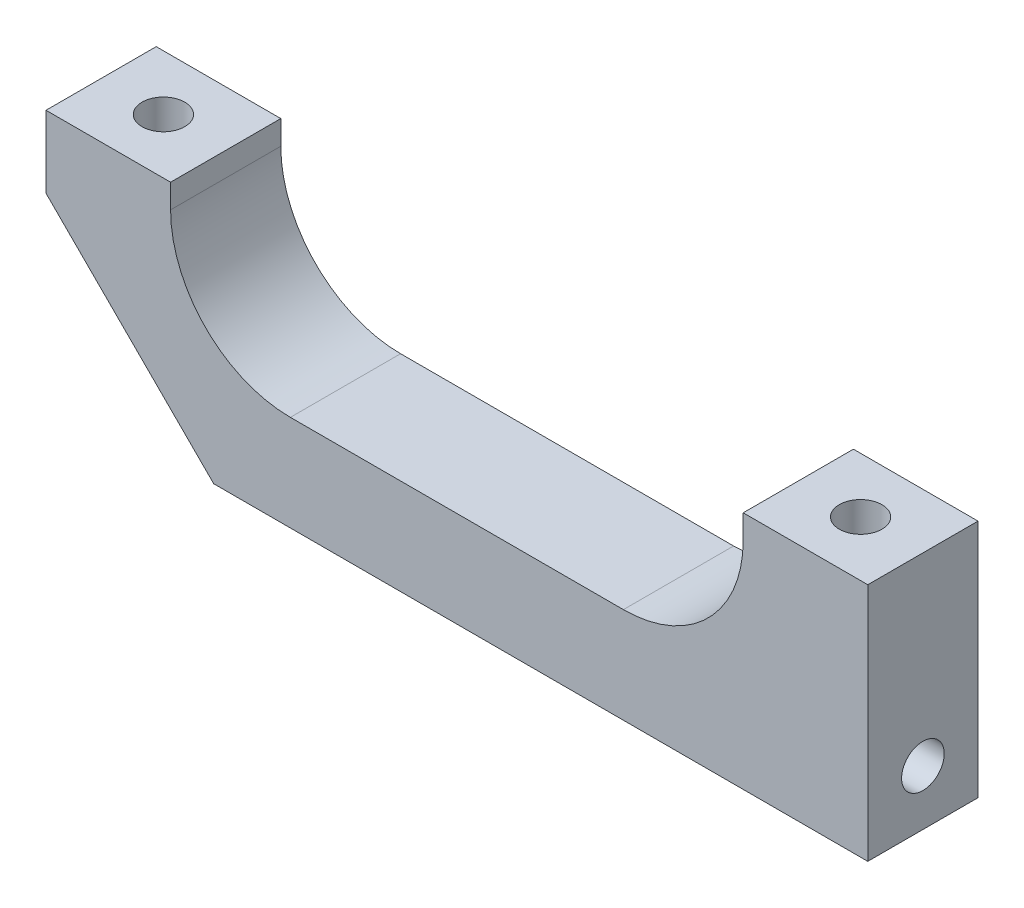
ISO-10303-21;
HEADER;
FILE_DESCRIPTION(('STEP AP214'),'2;1');
FILE_NAME('part.step','',(''),(''),'','','');
FILE_SCHEMA(('AUTOMOTIVE_DESIGN { 1 0 10303 214 1 1 1 1 }'));
ENDSEC;
DATA;
#1=APPLICATION_CONTEXT('core data for automotive mechanical design processes');
#2=APPLICATION_PROTOCOL_DEFINITION('international standard','automotive_design',2000,#1);
#3=PRODUCT_CONTEXT('',#1,'mechanical');
#4=PRODUCT('Part','Part','',(#3));
#5=PRODUCT_RELATED_PRODUCT_CATEGORY('part','',(#4));
#6=PRODUCT_DEFINITION_FORMATION('','',#4);
#7=PRODUCT_DEFINITION_CONTEXT('part definition',#1,'design');
#8=PRODUCT_DEFINITION('design','',#6,#7);
#9=PRODUCT_DEFINITION_SHAPE('','',#8);
#10=(LENGTH_UNIT() NAMED_UNIT(*) SI_UNIT(.MILLI.,.METRE.));
#11=(NAMED_UNIT(*) PLANE_ANGLE_UNIT() SI_UNIT($,.RADIAN.));
#12=(NAMED_UNIT(*) SI_UNIT($,.STERADIAN.) SOLID_ANGLE_UNIT());
#13=UNCERTAINTY_MEASURE_WITH_UNIT(LENGTH_MEASURE(1.E-05),#10,'distance_accuracy_value','');
#14=(GEOMETRIC_REPRESENTATION_CONTEXT(3) GLOBAL_UNCERTAINTY_ASSIGNED_CONTEXT((#13)) GLOBAL_UNIT_ASSIGNED_CONTEXT((#10,
#11,#12)) REPRESENTATION_CONTEXT('',''));
#15=CARTESIAN_POINT('',(0.,0.,0.));
#16=DIRECTION('',(0.,0.,1.));
#17=DIRECTION('',(1.,0.,0.));
#18=AXIS2_PLACEMENT_3D('',#15,#16,#17);
#19=CARTESIAN_POINT('',(0.,0.,5.842));
#20=DIRECTION('',(0.,-1.,0.));
#21=DIRECTION('',(0.,0.,-1.));
#22=AXIS2_PLACEMENT_3D('',#19,#20,#21);
#23=PLANE('',#22);
#24=CARTESIAN_POINT('',(3.302,0.,2.921));
#25=DIRECTION('',(0.,1.,0.));
#26=DIRECTION('',(0.,0.,1.));
#27=AXIS2_PLACEMENT_3D('',#24,#25,#26);
#28=CIRCLE('',#27,1.13029999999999);
#29=CARTESIAN_POINT('',(3.302,0.,4.05129999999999));
#30=VERTEX_POINT('',#29);
#31=EDGE_CURVE('E144',#30,#30,#28,.T.);
#32=ORIENTED_EDGE('',*,*,#31,.F.);
#33=EDGE_LOOP('',(#32));
#34=FACE_BOUND('',#33,.T.);
#35=DIRECTION('',(-1.,0.,0.));
#36=VECTOR('',#35,1.);
#37=CARTESIAN_POINT('',(0.,0.,5.842));
#38=LINE('',#37,#36);
#39=CARTESIAN_POINT('',(6.604,0.,5.842));
#40=VERTEX_POINT('',#39);
#41=CARTESIAN_POINT('',(0.,0.,5.842));
#42=VERTEX_POINT('',#41);
#43=EDGE_CURVE('E284',#40,#42,#38,.T.);
#44=ORIENTED_EDGE('',*,*,#43,.F.);
#45=DIRECTION('',(0.,0.,1.));
#46=VECTOR('',#45,1.);
#47=CARTESIAN_POINT('',(6.604,0.,0.));
#48=LINE('',#47,#46);
#49=CARTESIAN_POINT('',(6.604,0.,0.));
#50=VERTEX_POINT('',#49);
#51=EDGE_CURVE('E254',#50,#40,#48,.T.);
#52=ORIENTED_EDGE('',*,*,#51,.F.);
#53=DIRECTION('',(-1.,0.,0.));
#54=VECTOR('',#53,1.);
#55=CARTESIAN_POINT('',(0.,0.,0.));
#56=LINE('',#55,#54);
#57=CARTESIAN_POINT('',(0.,0.,0.));
#58=VERTEX_POINT('',#57);
#59=EDGE_CURVE('E265',#50,#58,#56,.T.);
#60=ORIENTED_EDGE('',*,*,#59,.T.);
#61=DIRECTION('',(0.,0.,-1.));
#62=VECTOR('',#61,1.);
#63=CARTESIAN_POINT('',(0.,0.,5.842));
#64=LINE('',#63,#62);
#65=EDGE_CURVE('E251',#42,#58,#64,.T.);
#66=ORIENTED_EDGE('',*,*,#65,.F.);
#67=EDGE_LOOP('',(#44,#52,#60,#66));
#68=FACE_BOUND('',#67,.T.);
#69=ADVANCED_FACE('F45',(#34,#68),#23,.F.);
#70=CARTESIAN_POINT('',(0.,0.,5.842));
#71=DIRECTION('',(1.,0.,0.));
#72=DIRECTION('',(0.,1.,0.));
#73=AXIS2_PLACEMENT_3D('',#70,#71,#72);
#74=PLANE('',#73);
#75=DIRECTION('',(0.,-1.,0.));
#76=VECTOR('',#75,1.);
#77=CARTESIAN_POINT('',(0.,0.,0.));
#78=LINE('',#77,#76);
#79=CARTESIAN_POINT('',(0.,-3.80999999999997,0.));
#80=VERTEX_POINT('',#79);
#81=EDGE_CURVE('E248',#58,#80,#78,.T.);
#82=ORIENTED_EDGE('',*,*,#81,.T.);
#83=DIRECTION('',(0.,0.,1.));
#84=VECTOR('',#83,1.);
#85=CARTESIAN_POINT('',(0.,-3.80999999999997,5.842));
#86=LINE('',#85,#84);
#87=CARTESIAN_POINT('',(0.,-3.80999999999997,5.842));
#88=VERTEX_POINT('',#87);
#89=EDGE_CURVE('E156',#80,#88,#86,.T.);
#90=ORIENTED_EDGE('',*,*,#89,.T.);
#91=DIRECTION('',(0.,-1.,0.));
#92=VECTOR('',#91,1.);
#93=CARTESIAN_POINT('',(0.,0.,5.842));
#94=LINE('',#93,#92);
#95=EDGE_CURVE('E269',#42,#88,#94,.T.);
#96=ORIENTED_EDGE('',*,*,#95,.F.);
#97=ORIENTED_EDGE('',*,*,#65,.T.);
#98=EDGE_LOOP('',(#82,#90,#96,#97));
#99=FACE_BOUND('',#98,.T.);
#100=ADVANCED_FACE('F237',(#99),#74,.F.);
#101=CARTESIAN_POINT('',(0.,-12.7,5.842));
#102=DIRECTION('',(0.,1.,0.));
#103=DIRECTION('',(0.,0.,1.));
#104=AXIS2_PLACEMENT_3D('',#101,#102,#103);
#105=PLANE('',#104);
#106=DIRECTION('',(1.,0.,0.));
#107=VECTOR('',#106,1.);
#108=CARTESIAN_POINT('',(0.,-12.7,5.842));
#109=LINE('',#108,#107);
#110=CARTESIAN_POINT('',(8.89000000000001,-12.7,5.842));
#111=VERTEX_POINT('',#110);
#112=CARTESIAN_POINT('',(43.561,-12.7,5.842));
#113=VERTEX_POINT('',#112);
#114=EDGE_CURVE('E280',#111,#113,#109,.T.);
#115=ORIENTED_EDGE('',*,*,#114,.F.);
#116=DIRECTION('',(0.,0.,-1.));
#117=VECTOR('',#116,1.);
#118=CARTESIAN_POINT('',(8.89,-12.7,5.842));
#119=LINE('',#118,#117);
#120=CARTESIAN_POINT('',(8.89,-12.7,0.));
#121=VERTEX_POINT('',#120);
#122=EDGE_CURVE('E158',#111,#121,#119,.T.);
#123=ORIENTED_EDGE('',*,*,#122,.T.);
#124=DIRECTION('',(1.,0.,0.));
#125=VECTOR('',#124,1.);
#126=CARTESIAN_POINT('',(0.,-12.7,0.));
#127=LINE('',#126,#125);
#128=CARTESIAN_POINT('',(43.561,-12.7,0.));
#129=VERTEX_POINT('',#128);
#130=EDGE_CURVE('E253',#121,#129,#127,.T.);
#131=ORIENTED_EDGE('',*,*,#130,.T.);
#132=DIRECTION('',(0.,0.,-1.));
#133=VECTOR('',#132,1.);
#134=CARTESIAN_POINT('',(43.561,-12.7,5.842));
#135=LINE('',#134,#133);
#136=EDGE_CURVE('E274',#113,#129,#135,.T.);
#137=ORIENTED_EDGE('',*,*,#136,.F.);
#138=EDGE_LOOP('',(#115,#123,#131,#137));
#139=FACE_BOUND('',#138,.T.);
#140=ADVANCED_FACE('F234',(#139),#105,.F.);
#141=CARTESIAN_POINT('',(43.561,0.,5.842));
#142=DIRECTION('',(-1.,0.,0.));
#143=DIRECTION('',(0.,0.,1.));
#144=AXIS2_PLACEMENT_3D('',#141,#142,#143);
#145=PLANE('',#144);
#146=CARTESIAN_POINT('',(43.561,-9.77899999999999,2.921));
#147=DIRECTION('',(1.,0.,0.));
#148=DIRECTION('',(0.,0.,-1.));
#149=AXIS2_PLACEMENT_3D('',#146,#147,#148);
#150=CIRCLE('',#149,1.13029999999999);
#151=CARTESIAN_POINT('',(43.561,-9.77899999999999,1.79070000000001));
#152=VERTEX_POINT('',#151);
#153=EDGE_CURVE('E299',#152,#152,#150,.T.);
#154=ORIENTED_EDGE('',*,*,#153,.F.);
#155=EDGE_LOOP('',(#154));
#156=FACE_BOUND('',#155,.T.);
#157=DIRECTION('',(0.,1.,0.));
#158=VECTOR('',#157,1.);
#159=CARTESIAN_POINT('',(43.561,0.,0.));
#160=LINE('',#159,#158);
#161=CARTESIAN_POINT('',(43.561,0.,0.));
#162=VERTEX_POINT('',#161);
#163=EDGE_CURVE('E256',#129,#162,#160,.T.);
#164=ORIENTED_EDGE('',*,*,#163,.T.);
#165=DIRECTION('',(0.,0.,-1.));
#166=VECTOR('',#165,1.);
#167=CARTESIAN_POINT('',(43.561,0.,5.842));
#168=LINE('',#167,#166);
#169=CARTESIAN_POINT('',(43.561,0.,5.842));
#170=VERTEX_POINT('',#169);
#171=EDGE_CURVE('E271',#170,#162,#168,.T.);
#172=ORIENTED_EDGE('',*,*,#171,.F.);
#173=DIRECTION('',(0.,1.,0.));
#174=VECTOR('',#173,1.);
#175=CARTESIAN_POINT('',(43.561,0.,5.842));
#176=LINE('',#175,#174);
#177=EDGE_CURVE('E282',#113,#170,#176,.T.);
#178=ORIENTED_EDGE('',*,*,#177,.F.);
#179=ORIENTED_EDGE('',*,*,#136,.T.);
#180=EDGE_LOOP('',(#164,#172,#178,#179));
#181=FACE_BOUND('',#180,.T.);
#182=ADVANCED_FACE('F230',(#156,#181),#145,.F.);
#183=CARTESIAN_POINT('',(40.259,0.,2.921));
#184=DIRECTION('',(0.,1.,0.));
#185=DIRECTION('',(0.,0.,1.));
#186=AXIS2_PLACEMENT_3D('',#183,#184,#185);
#187=CIRCLE('',#186,1.13029999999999);
#188=CARTESIAN_POINT('',(40.259,0.,4.05129999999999));
#189=VERTEX_POINT('',#188);
#190=EDGE_CURVE('E310',#189,#189,#187,.T.);
#191=ORIENTED_EDGE('',*,*,#190,.F.);
#192=EDGE_LOOP('',(#191));
#193=FACE_BOUND('',#192,.T.);
#194=CARTESIAN_POINT('',(36.957,0.,0.));
#195=VERTEX_POINT('',#194);
#196=EDGE_CURVE('E266',#162,#195,#56,.T.);
#197=ORIENTED_EDGE('',*,*,#196,.T.);
#198=DIRECTION('',(0.,0.,1.));
#199=VECTOR('',#198,1.);
#200=CARTESIAN_POINT('',(36.957,0.,0.));
#201=LINE('',#200,#199);
#202=CARTESIAN_POINT('',(36.957,0.,5.842));
#203=VERTEX_POINT('',#202);
#204=EDGE_CURVE('E258',#195,#203,#201,.T.);
#205=ORIENTED_EDGE('',*,*,#204,.T.);
#206=EDGE_CURVE('E261',#170,#203,#38,.T.);
#207=ORIENTED_EDGE('',*,*,#206,.F.);
#208=ORIENTED_EDGE('',*,*,#171,.T.);
#209=EDGE_LOOP('',(#197,#205,#207,#208));
#210=FACE_BOUND('',#209,.T.);
#211=ADVANCED_FACE('F225',(#193,#210),#23,.F.);
#212=CARTESIAN_POINT('',(0.,-12.7,5.842));
#213=DIRECTION('',(0.,0.,1.));
#214=DIRECTION('',(1.,0.,0.));
#215=AXIS2_PLACEMENT_3D('',#212,#213,#214);
#216=PLANE('',#215);
#217=ORIENTED_EDGE('',*,*,#95,.T.);
#218=DIRECTION('',(-0.707106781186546,0.707106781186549,0.));
#219=VECTOR('',#218,1.);
#220=CARTESIAN_POINT('',(4.44500000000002,-8.255,5.842));
#221=LINE('',#220,#219);
#222=EDGE_CURVE('E155',#88,#111,#221,.F.);
#223=ORIENTED_EDGE('',*,*,#222,.T.);
#224=ORIENTED_EDGE('',*,*,#114,.T.);
#225=ORIENTED_EDGE('',*,*,#177,.T.);
#226=ORIENTED_EDGE('',*,*,#206,.T.);
#227=DIRECTION('',(0.,1.,0.));
#228=VECTOR('',#227,1.);
#229=CARTESIAN_POINT('',(36.957,0.,5.842));
#230=LINE('',#229,#228);
#231=CARTESIAN_POINT('',(36.957,-1.27,5.842));
#232=VERTEX_POINT('',#231);
#233=EDGE_CURVE('E290',#232,#203,#230,.T.);
#234=ORIENTED_EDGE('',*,*,#233,.F.);
#235=CARTESIAN_POINT('',(30.607,-1.27,5.842));
#236=DIRECTION('',(0.,0.,1.));
#237=DIRECTION('',(1.,0.,0.));
#238=AXIS2_PLACEMENT_3D('',#235,#236,#237);
#239=CIRCLE('',#238,6.35);
#240=CARTESIAN_POINT('',(30.607,-7.62,5.842));
#241=VERTEX_POINT('',#240);
#242=EDGE_CURVE('E181',#232,#241,#239,.F.);
#243=ORIENTED_EDGE('',*,*,#242,.T.);
#244=DIRECTION('',(1.,0.,0.));
#245=VECTOR('',#244,1.);
#246=CARTESIAN_POINT('',(6.604,-7.62,5.842));
#247=LINE('',#246,#245);
#248=CARTESIAN_POINT('',(12.954,-7.62,5.842));
#249=VERTEX_POINT('',#248);
#250=EDGE_CURVE('E293',#249,#241,#247,.T.);
#251=ORIENTED_EDGE('',*,*,#250,.F.);
#252=CARTESIAN_POINT('',(12.954,-1.27,5.842));
#253=DIRECTION('',(0.,0.,1.));
#254=DIRECTION('',(1.,0.,0.));
#255=AXIS2_PLACEMENT_3D('',#252,#253,#254);
#256=CIRCLE('',#255,6.35);
#257=CARTESIAN_POINT('',(6.604,-1.27,5.842));
#258=VERTEX_POINT('',#257);
#259=EDGE_CURVE('E177',#249,#258,#256,.F.);
#260=ORIENTED_EDGE('',*,*,#259,.T.);
#261=DIRECTION('',(0.,-1.,0.));
#262=VECTOR('',#261,1.);
#263=CARTESIAN_POINT('',(6.604,0.,5.842));
#264=LINE('',#263,#262);
#265=EDGE_CURVE('E296',#40,#258,#264,.T.);
#266=ORIENTED_EDGE('',*,*,#265,.F.);
#267=ORIENTED_EDGE('',*,*,#43,.T.);
#268=EDGE_LOOP('',(#217,#223,#224,#225,#226,#234,#243,#251,#260,#266,#267));
#269=FACE_BOUND('',#268,.T.);
#270=ADVANCED_FACE('F222',(#269),#216,.T.);
#271=CARTESIAN_POINT('',(0.,-12.7,0.));
#272=DIRECTION('',(0.,0.,1.));
#273=DIRECTION('',(1.,0.,0.));
#274=AXIS2_PLACEMENT_3D('',#271,#272,#273);
#275=PLANE('',#274);
#276=ORIENTED_EDGE('',*,*,#130,.F.);
#277=DIRECTION('',(0.707106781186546,-0.707106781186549,0.));
#278=VECTOR('',#277,1.);
#279=CARTESIAN_POINT('',(8.89,-12.7,0.));
#280=LINE('',#279,#278);
#281=EDGE_CURVE('E166',#121,#80,#280,.F.);
#282=ORIENTED_EDGE('',*,*,#281,.T.);
#283=ORIENTED_EDGE('',*,*,#81,.F.);
#284=ORIENTED_EDGE('',*,*,#59,.F.);
#285=DIRECTION('',(0.,-1.,0.));
#286=VECTOR('',#285,1.);
#287=CARTESIAN_POINT('',(6.604,0.,0.));
#288=LINE('',#287,#286);
#289=CARTESIAN_POINT('',(6.604,-1.27,0.));
#290=VERTEX_POINT('',#289);
#291=EDGE_CURVE('E292',#50,#290,#288,.T.);
#292=ORIENTED_EDGE('',*,*,#291,.T.);
#293=CARTESIAN_POINT('',(12.954,-1.27,0.));
#294=DIRECTION('',(0.,0.,1.));
#295=DIRECTION('',(1.,0.,0.));
#296=AXIS2_PLACEMENT_3D('',#293,#294,#295);
#297=CIRCLE('',#296,6.35);
#298=CARTESIAN_POINT('',(12.954,-7.62,0.));
#299=VERTEX_POINT('',#298);
#300=EDGE_CURVE('E179',#290,#299,#297,.T.);
#301=ORIENTED_EDGE('',*,*,#300,.T.);
#302=DIRECTION('',(1.,0.,0.));
#303=VECTOR('',#302,1.);
#304=CARTESIAN_POINT('',(6.604,-7.62,0.));
#305=LINE('',#304,#303);
#306=CARTESIAN_POINT('',(30.607,-7.62,0.));
#307=VERTEX_POINT('',#306);
#308=EDGE_CURVE('E301',#299,#307,#305,.T.);
#309=ORIENTED_EDGE('',*,*,#308,.T.);
#310=CARTESIAN_POINT('',(30.607,-1.27,0.));
#311=DIRECTION('',(0.,0.,1.));
#312=DIRECTION('',(1.,0.,0.));
#313=AXIS2_PLACEMENT_3D('',#310,#311,#312);
#314=CIRCLE('',#313,6.35);
#315=CARTESIAN_POINT('',(36.957,-1.27,0.));
#316=VERTEX_POINT('',#315);
#317=EDGE_CURVE('E66',#307,#316,#314,.T.);
#318=ORIENTED_EDGE('',*,*,#317,.T.);
#319=DIRECTION('',(0.,1.,0.));
#320=VECTOR('',#319,1.);
#321=CARTESIAN_POINT('',(36.957,0.,0.));
#322=LINE('',#321,#320);
#323=EDGE_CURVE('E288',#316,#195,#322,.T.);
#324=ORIENTED_EDGE('',*,*,#323,.T.);
#325=ORIENTED_EDGE('',*,*,#196,.F.);
#326=ORIENTED_EDGE('',*,*,#163,.F.);
#327=EDGE_LOOP('',(#276,#282,#283,#284,#292,#301,#309,#318,#324,#325,#326));
#328=FACE_BOUND('',#327,.T.);
#329=ADVANCED_FACE('F220',(#328),#275,.F.);
#330=CARTESIAN_POINT('',(6.604,0.,0.));
#331=DIRECTION('',(-1.,0.,0.));
#332=DIRECTION('',(0.,-1.,0.));
#333=AXIS2_PLACEMENT_3D('',#330,#331,#332);
#334=PLANE('',#333);
#335=ORIENTED_EDGE('',*,*,#265,.T.);
#336=DIRECTION('',(0.,0.,1.));
#337=VECTOR('',#336,1.);
#338=CARTESIAN_POINT('',(6.604,-1.27,0.));
#339=LINE('',#338,#337);
#340=EDGE_CURVE('E172',#258,#290,#339,.F.);
#341=ORIENTED_EDGE('',*,*,#340,.T.);
#342=ORIENTED_EDGE('',*,*,#291,.F.);
#343=ORIENTED_EDGE('',*,*,#51,.T.);
#344=EDGE_LOOP('',(#335,#341,#342,#343));
#345=FACE_BOUND('',#344,.T.);
#346=ADVANCED_FACE('F213',(#345),#334,.F.);
#347=CARTESIAN_POINT('',(36.957,0.,0.));
#348=DIRECTION('',(1.,0.,0.));
#349=DIRECTION('',(0.,0.,-1.));
#350=AXIS2_PLACEMENT_3D('',#347,#348,#349);
#351=PLANE('',#350);
#352=ORIENTED_EDGE('',*,*,#323,.F.);
#353=DIRECTION('',(0.,0.,1.));
#354=VECTOR('',#353,1.);
#355=CARTESIAN_POINT('',(36.957,-1.27,5.842));
#356=LINE('',#355,#354);
#357=EDGE_CURVE('E174',#316,#232,#356,.T.);
#358=ORIENTED_EDGE('',*,*,#357,.T.);
#359=ORIENTED_EDGE('',*,*,#233,.T.);
#360=ORIENTED_EDGE('',*,*,#204,.F.);
#361=EDGE_LOOP('',(#352,#358,#359,#360));
#362=FACE_BOUND('',#361,.T.);
#363=ADVANCED_FACE('F210',(#362),#351,.F.);
#364=CARTESIAN_POINT('',(6.604,-7.62,0.));
#365=DIRECTION('',(0.,-1.,0.));
#366=DIRECTION('',(0.,0.,-1.));
#367=AXIS2_PLACEMENT_3D('',#364,#365,#366);
#368=PLANE('',#367);
#369=ORIENTED_EDGE('',*,*,#308,.F.);
#370=DIRECTION('',(0.,0.,1.));
#371=VECTOR('',#370,1.);
#372=CARTESIAN_POINT('',(12.954,-7.62,5.842));
#373=LINE('',#372,#371);
#374=EDGE_CURVE('E164',#299,#249,#373,.T.);
#375=ORIENTED_EDGE('',*,*,#374,.T.);
#376=ORIENTED_EDGE('',*,*,#250,.T.);
#377=DIRECTION('',(0.,0.,1.));
#378=VECTOR('',#377,1.);
#379=CARTESIAN_POINT('',(30.607,-7.62,0.));
#380=LINE('',#379,#378);
#381=EDGE_CURVE('E162',#241,#307,#380,.F.);
#382=ORIENTED_EDGE('',*,*,#381,.T.);
#383=EDGE_LOOP('',(#369,#375,#376,#382));
#384=FACE_BOUND('',#383,.T.);
#385=ADVANCED_FACE('F150',(#384),#368,.F.);
#386=CARTESIAN_POINT('',(8.89,-12.7,5.842));
#387=DIRECTION('',(0.707106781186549,0.707106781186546,0.));
#388=DIRECTION('',(-0.707106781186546,0.707106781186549,0.));
#389=AXIS2_PLACEMENT_3D('',#386,#387,#388);
#390=PLANE('',#389);
#391=CARTESIAN_POINT('',(3.302,-7.11199999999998,2.921));
#392=DIRECTION('',(0.707106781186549,0.707106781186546,0.));
#393=DIRECTION('',(-0.707106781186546,0.707106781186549,0.));
#394=AXIS2_PLACEMENT_3D('',#391,#392,#393);
#395=ELLIPSE('',#394,1.5984855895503,1.13029999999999);
#396=CARTESIAN_POINT('',(3.78460000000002,-7.5946,3.94309360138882));
#397=VERTEX_POINT('',#396);
#398=CARTESIAN_POINT('',(3.78460000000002,-7.5946,1.89890639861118));
#399=VERTEX_POINT('',#398);
#400=EDGE_CURVE('E13',#397,#399,#395,.F.);
#401=ORIENTED_EDGE('',*,*,#400,.F.);
#402=CARTESIAN_POINT('',(3.78440000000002,-7.5944,1.89844394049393));
#403=CARTESIAN_POINT('',(3.8069358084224,-7.61693580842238,1.95060958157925));
#404=CARTESIAN_POINT('',(3.82869075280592,-7.6386907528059,2.00351505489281));
#405=CARTESIAN_POINT('',(3.87008660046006,-7.68008660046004,2.11127000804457));
#406=CARTESIAN_POINT('',(3.88971700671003,-7.69971700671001,2.16612750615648));
#407=CARTESIAN_POINT('',(3.9263774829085,-7.73637748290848,2.27865665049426));
#408=CARTESIAN_POINT('',(3.94336076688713,-7.75336076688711,2.33635933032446));
#409=CARTESIAN_POINT('',(3.9733737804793,-7.78337378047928,2.45371719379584));
#410=CARTESIAN_POINT('',(3.98641095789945,-7.79641095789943,2.51336846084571));
#411=CARTESIAN_POINT('',(4.00398771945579,-7.81398771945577,2.61402231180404));
#412=CARTESIAN_POINT('',(4.00991047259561,-7.8199104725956,2.65454247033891));
#413=CARTESIAN_POINT('',(4.01932170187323,-7.82932170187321,2.73615702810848));
#414=CARTESIAN_POINT('',(4.02281006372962,-7.8328100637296,2.77725145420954));
#415=CARTESIAN_POINT('',(4.02715304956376,-7.83715304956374,2.85936983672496));
#416=CARTESIAN_POINT('',(4.02802979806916,-7.83802979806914,2.90039142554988));
#417=CARTESIAN_POINT('',(4.02716555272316,-7.83716555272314,2.98237763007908));
#418=CARTESIAN_POINT('',(4.0254246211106,-7.83542462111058,3.02334224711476));
#419=CARTESIAN_POINT('',(4.01942738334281,-7.82942738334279,3.10475914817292));
#420=CARTESIAN_POINT('',(4.01517945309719,-7.82517945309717,3.14521268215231));
#421=CARTESIAN_POINT('',(4.00437964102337,-7.81437964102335,3.22550741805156));
#422=CARTESIAN_POINT('',(3.99782668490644,-7.80782668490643,3.26534832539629));
#423=CARTESIAN_POINT('',(3.97500546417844,-7.78500546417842,3.3842486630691));
#424=CARTESIAN_POINT('',(3.95562281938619,-7.76562281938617,3.46212049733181));
#425=CARTESIAN_POINT('',(3.91244954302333,-7.72244954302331,3.60910243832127));
#426=CARTESIAN_POINT('',(3.88904404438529,-7.69904404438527,3.67844933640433));
#427=CARTESIAN_POINT('',(3.8513759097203,-7.66137590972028,3.77991125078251));
#428=CARTESIAN_POINT('',(3.83849553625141,-7.64849553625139,3.81307425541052));
#429=CARTESIAN_POINT('',(3.81198198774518,-7.62198198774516,3.87876863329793));
#430=CARTESIAN_POINT('',(3.7983492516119,-7.60834925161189,3.9113003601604));
#431=CARTESIAN_POINT('',(3.78440000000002,-7.5944,3.94355605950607));
#432=B_SPLINE_CURVE_WITH_KNOTS('',3,(#402,#403,#404,#405,#406,#407,#408,#409,#410,#411,#412,
#413,#414,#415,#416,#417,#418,#419,#420,#421,#422,#423,#424,#425,#426,#427,#428,#429,#430,#431),
.UNSPECIFIED.,.F.,.F.,(4,2,2,2,2,2,2,2,2,2,2,2,2,2,4),(0.,0.183462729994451,0.367794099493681,
0.555083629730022,0.74201743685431,0.866019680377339,0.990027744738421,1.11298223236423,
1.23593379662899,1.35847688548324,1.4810771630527,1.72796733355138,1.95821767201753,
2.07171004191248,2.18513688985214),.UNSPECIFIED.);
#433=EDGE_CURVE('E53',#399,#397,#432,.T.);
#434=ORIENTED_EDGE('',*,*,#433,.F.);
#435=EDGE_LOOP('',(#401,#434));
#436=FACE_BOUND('',#435,.T.);
#437=ORIENTED_EDGE('',*,*,#222,.F.);
#438=ORIENTED_EDGE('',*,*,#89,.F.);
#439=ORIENTED_EDGE('',*,*,#281,.F.);
#440=ORIENTED_EDGE('',*,*,#122,.F.);
#441=EDGE_LOOP('',(#437,#438,#439,#440));
#442=FACE_BOUND('',#441,.T.);
#443=ADVANCED_FACE('F146',(#436,#442),#390,.F.);
#444=CARTESIAN_POINT('',(12.954,-1.27,0.));
#445=DIRECTION('',(0.,0.,-1.));
#446=DIRECTION('',(-1.,0.,0.));
#447=AXIS2_PLACEMENT_3D('',#444,#445,#446);
#448=CYLINDRICAL_SURFACE('',#447,6.35);
#449=ORIENTED_EDGE('',*,*,#300,.F.);
#450=ORIENTED_EDGE('',*,*,#340,.F.);
#451=ORIENTED_EDGE('',*,*,#259,.F.);
#452=ORIENTED_EDGE('',*,*,#374,.F.);
#453=EDGE_LOOP('',(#449,#450,#451,#452));
#454=FACE_BOUND('',#453,.T.);
#455=ADVANCED_FACE('F149',(#454),#448,.F.);
#456=CARTESIAN_POINT('',(30.607,-1.27,0.));
#457=DIRECTION('',(0.,0.,-1.));
#458=DIRECTION('',(-1.,0.,0.));
#459=AXIS2_PLACEMENT_3D('',#456,#457,#458);
#460=CYLINDRICAL_SURFACE('',#459,6.35);
#461=ORIENTED_EDGE('',*,*,#317,.F.);
#462=ORIENTED_EDGE('',*,*,#381,.F.);
#463=ORIENTED_EDGE('',*,*,#242,.F.);
#464=ORIENTED_EDGE('',*,*,#357,.F.);
#465=EDGE_LOOP('',(#461,#462,#463,#464));
#466=FACE_BOUND('',#465,.T.);
#467=ADVANCED_FACE('F47',(#466),#460,.F.);
#468=CARTESIAN_POINT('',(43.561,-9.77899999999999,2.921));
#469=DIRECTION('',(1.,0.,0.));
#470=DIRECTION('',(0.,0.,-1.));
#471=AXIS2_PLACEMENT_3D('',#468,#469,#470);
#472=CYLINDRICAL_SURFACE('',#471,1.13029999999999);
#473=CARTESIAN_POINT('',(35.052,-9.77899999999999,2.921));
#474=DIRECTION('',(1.,0.,0.));
#475=DIRECTION('',(0.,0.,-1.));
#476=AXIS2_PLACEMENT_3D('',#473,#474,#475);
#477=CIRCLE('',#476,1.1303);
#478=CARTESIAN_POINT('',(35.052,-9.77899999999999,1.7907));
#479=VERTEX_POINT('',#478);
#480=EDGE_CURVE('E307',#479,#479,#477,.T.);
#481=ORIENTED_EDGE('',*,*,#480,.F.);
#482=EDGE_LOOP('',(#481));
#483=FACE_BOUND('',#482,.T.);
#484=ORIENTED_EDGE('',*,*,#153,.T.);
#485=EDGE_LOOP('',(#484));
#486=FACE_BOUND('',#485,.T.);
#487=ADVANCED_FACE('F205',(#483,#486),#472,.F.);
#488=CARTESIAN_POINT('',(35.052,-9.77899999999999,2.921));
#489=DIRECTION('',(1.,0.,0.));
#490=DIRECTION('',(0.,0.,-1.));
#491=AXIS2_PLACEMENT_3D('',#488,#489,#490);
#492=CONICAL_SURFACE('',#491,1.1303,1.02974425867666);
#493=CARTESIAN_POINT('',(34.3728472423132,-9.77899999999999,2.921));
#494=VERTEX_POINT('',#493);
#495=VERTEX_LOOP('',#494);
#496=FACE_BOUND('',#495,.T.);
#497=ORIENTED_EDGE('',*,*,#480,.T.);
#498=EDGE_LOOP('',(#497));
#499=FACE_BOUND('',#498,.T.);
#500=ADVANCED_FACE('F201',(#496,#499),#492,.F.);
#501=CARTESIAN_POINT('',(40.259,0.,2.921));
#502=DIRECTION('',(0.,1.,0.));
#503=DIRECTION('',(0.,0.,1.));
#504=AXIS2_PLACEMENT_3D('',#501,#502,#503);
#505=CYLINDRICAL_SURFACE('',#504,1.13029999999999);
#506=CARTESIAN_POINT('',(40.259,-7.5946,2.921));
#507=DIRECTION('',(0.,1.,0.));
#508=DIRECTION('',(0.,0.,1.));
#509=AXIS2_PLACEMENT_3D('',#506,#507,#508);
#510=CIRCLE('',#509,1.1303);
#511=CARTESIAN_POINT('',(40.259,-7.5946,4.0513));
#512=VERTEX_POINT('',#511);
#513=EDGE_CURVE('E313',#512,#512,#510,.T.);
#514=ORIENTED_EDGE('',*,*,#513,.F.);
#515=EDGE_LOOP('',(#514));
#516=FACE_BOUND('',#515,.T.);
#517=ORIENTED_EDGE('',*,*,#190,.T.);
#518=EDGE_LOOP('',(#517));
#519=FACE_BOUND('',#518,.T.);
#520=ADVANCED_FACE('F197',(#516,#519),#505,.F.);
#521=CARTESIAN_POINT('',(40.259,-7.5946,2.921));
#522=DIRECTION('',(0.,1.,0.));
#523=DIRECTION('',(0.,0.,1.));
#524=AXIS2_PLACEMENT_3D('',#521,#522,#523);
#525=CONICAL_SURFACE('',#524,1.1303,1.02974425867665);
#526=CARTESIAN_POINT('',(40.259,-8.27375275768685,2.921));
#527=VERTEX_POINT('',#526);
#528=VERTEX_LOOP('',#527);
#529=FACE_BOUND('',#528,.T.);
#530=ORIENTED_EDGE('',*,*,#513,.T.);
#531=EDGE_LOOP('',(#530));
#532=FACE_BOUND('',#531,.T.);
#533=ADVANCED_FACE('F194',(#529,#532),#525,.F.);
#534=CARTESIAN_POINT('',(3.302,0.,2.921));
#535=DIRECTION('',(0.,1.,0.));
#536=DIRECTION('',(0.,0.,1.));
#537=AXIS2_PLACEMENT_3D('',#534,#535,#536);
#538=CYLINDRICAL_SURFACE('',#537,1.13029999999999);
#539=ORIENTED_EDGE('',*,*,#400,.T.);
#540=CARTESIAN_POINT('',(3.302,-7.5946,2.921));
#541=DIRECTION('',(0.,1.,0.));
#542=DIRECTION('',(0.,0.,1.));
#543=AXIS2_PLACEMENT_3D('',#540,#541,#542);
#544=CIRCLE('',#543,1.1303);
#545=EDGE_CURVE('E59',#397,#399,#544,.T.);
#546=ORIENTED_EDGE('',*,*,#545,.F.);
#547=EDGE_LOOP('',(#539,#546));
#548=FACE_BOUND('',#547,.T.);
#549=ORIENTED_EDGE('',*,*,#31,.T.);
#550=EDGE_LOOP('',(#549));
#551=FACE_BOUND('',#550,.T.);
#552=ADVANCED_FACE('F142',(#548,#551),#538,.F.);
#553=CARTESIAN_POINT('',(3.302,-7.5946,2.921));
#554=DIRECTION('',(0.,1.,0.));
#555=DIRECTION('',(0.,0.,1.));
#556=AXIS2_PLACEMENT_3D('',#553,#554,#555);
#557=CONICAL_SURFACE('',#556,1.1303,1.02974425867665);
#558=ORIENTED_EDGE('',*,*,#433,.T.);
#559=ORIENTED_EDGE('',*,*,#545,.T.);
#560=EDGE_LOOP('',(#558,#559));
#561=FACE_BOUND('',#560,.T.);
#562=ADVANCED_FACE('F138',(#561),#557,.F.);
#563=CLOSED_SHELL('',(#69,#100,#140,#182,#211,#270,#329,#346,#363,#385,#443,#455,#467,#487,#500,
#520,#533,#552,#562));
#564=MANIFOLD_SOLID_BREP('B2',#563);
#565=ADVANCED_BREP_SHAPE_REPRESENTATION('',(#18,#564),#14);
#566=SHAPE_DEFINITION_REPRESENTATION(#9,#565);
ENDSEC;
END-ISO-10303-21;
